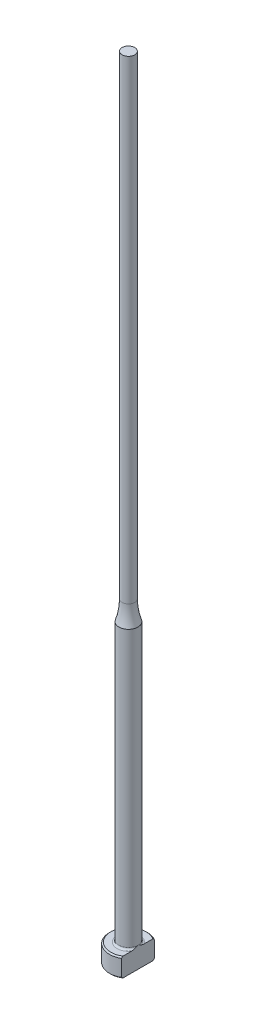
ISO-10303-21;
HEADER;
FILE_DESCRIPTION(('STEP AP214'),'2;1');
FILE_NAME('part.step','',(''),(''),'','','');
FILE_SCHEMA(('AUTOMOTIVE_DESIGN { 1 0 10303 214 1 1 1 1 }'));
ENDSEC;
DATA;
#1=APPLICATION_CONTEXT('core data for automotive mechanical design processes');
#2=APPLICATION_PROTOCOL_DEFINITION('international standard','automotive_design',2000,#1);
#3=PRODUCT_CONTEXT('',#1,'mechanical');
#4=PRODUCT('Part','Part','',(#3));
#5=PRODUCT_RELATED_PRODUCT_CATEGORY('part','',(#4));
#6=PRODUCT_DEFINITION_FORMATION('','',#4);
#7=PRODUCT_DEFINITION_CONTEXT('part definition',#1,'design');
#8=PRODUCT_DEFINITION('design','',#6,#7);
#9=PRODUCT_DEFINITION_SHAPE('','',#8);
#10=(LENGTH_UNIT() NAMED_UNIT(*) SI_UNIT(.MILLI.,.METRE.));
#11=(NAMED_UNIT(*) PLANE_ANGLE_UNIT() SI_UNIT($,.RADIAN.));
#12=(NAMED_UNIT(*) SI_UNIT($,.STERADIAN.) SOLID_ANGLE_UNIT());
#13=UNCERTAINTY_MEASURE_WITH_UNIT(LENGTH_MEASURE(1.E-05),#10,'distance_accuracy_value','');
#14=(GEOMETRIC_REPRESENTATION_CONTEXT(3) GLOBAL_UNCERTAINTY_ASSIGNED_CONTEXT((#13)) GLOBAL_UNIT_ASSIGNED_CONTEXT((#10,
#11,#12)) REPRESENTATION_CONTEXT('',''));
#15=CARTESIAN_POINT('',(0.,0.,0.));
#16=DIRECTION('',(0.,0.,1.));
#17=DIRECTION('',(1.,0.,0.));
#18=AXIS2_PLACEMENT_3D('',#15,#16,#17);
#19=CARTESIAN_POINT('',(-2.99999999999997,3.,0.));
#20=DIRECTION('',(0.,1.,0.));
#21=DIRECTION('',(0.,0.,1.));
#22=AXIS2_PLACEMENT_3D('',#19,#20,#21);
#23=PLANE('',#22);
#24=CARTESIAN_POINT('',(0.,3.,0.));
#25=DIRECTION('',(0.,1.,0.));
#26=DIRECTION('',(0.,0.,1.));
#27=AXIS2_PLACEMENT_3D('',#24,#25,#26);
#28=CIRCLE('',#27,2.79999999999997);
#29=CARTESIAN_POINT('',(1.49999999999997,3.,-2.36431808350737));
#30=VERTEX_POINT('',#29);
#31=CARTESIAN_POINT('',(1.49999999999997,3.,2.36431808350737));
#32=VERTEX_POINT('',#31);
#33=EDGE_CURVE('E187',#30,#32,#28,.T.);
#34=ORIENTED_EDGE('',*,*,#33,.T.);
#35=DIRECTION('',(0.,0.,-1.));
#36=VECTOR('',#35,1.);
#37=CARTESIAN_POINT('',(1.49999999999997,3.,0.));
#38=LINE('',#37,#36);
#39=CARTESIAN_POINT('',(1.49999999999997,3.00000000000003,0.99498743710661));
#40=VERTEX_POINT('',#39);
#41=EDGE_CURVE('E57',#32,#40,#38,.T.);
#42=ORIENTED_EDGE('',*,*,#41,.T.);
#43=CARTESIAN_POINT('',(0.,3.,0.));
#44=DIRECTION('',(0.,1.,0.));
#45=DIRECTION('',(0.,0.,1.));
#46=AXIS2_PLACEMENT_3D('',#43,#44,#45);
#47=CIRCLE('',#46,1.79999999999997);
#48=CARTESIAN_POINT('',(1.49999999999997,3.00000000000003,-0.994987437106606));
#49=VERTEX_POINT('',#48);
#50=EDGE_CURVE('E108',#40,#49,#47,.F.);
#51=ORIENTED_EDGE('',*,*,#50,.T.);
#52=EDGE_CURVE('E137',#49,#30,#38,.T.);
#53=ORIENTED_EDGE('',*,*,#52,.T.);
#54=EDGE_LOOP('',(#34,#42,#51,#53));
#55=FACE_BOUND('',#54,.T.);
#56=ADVANCED_FACE('F32',(#55),#23,.T.);
#57=CARTESIAN_POINT('',(0.,259.958771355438,0.));
#58=DIRECTION('',(0.,1.,0.));
#59=DIRECTION('',(0.,0.,1.));
#60=AXIS2_PLACEMENT_3D('',#57,#58,#59);
#61=CYLINDRICAL_SURFACE('',#60,2.99999999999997);
#62=CARTESIAN_POINT('',(0.,2.80000000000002,0.));
#63=DIRECTION('',(0.,1.,0.));
#64=DIRECTION('',(0.,0.,1.));
#65=AXIS2_PLACEMENT_3D('',#62,#63,#64);
#66=CIRCLE('',#65,2.99999999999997);
#67=CARTESIAN_POINT('',(1.49999999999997,2.80000000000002,2.5980762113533));
#68=VERTEX_POINT('',#67);
#69=CARTESIAN_POINT('',(1.49999999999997,2.80000000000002,-2.5980762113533));
#70=VERTEX_POINT('',#69);
#71=EDGE_CURVE('E105',#68,#70,#66,.F.);
#72=ORIENTED_EDGE('',*,*,#71,.T.);
#73=DIRECTION('',(0.,-1.,0.));
#74=VECTOR('',#73,1.);
#75=CARTESIAN_POINT('',(1.49999999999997,125.,-2.5980762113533));
#76=LINE('',#75,#74);
#77=CARTESIAN_POINT('',(1.49999999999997,0.200000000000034,-2.5980762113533));
#78=VERTEX_POINT('',#77);
#79=EDGE_CURVE('E193',#70,#78,#76,.T.);
#80=ORIENTED_EDGE('',*,*,#79,.T.);
#81=CARTESIAN_POINT('',(0.,0.200000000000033,0.));
#82=DIRECTION('',(0.,-1.,0.));
#83=DIRECTION('',(0.,0.,-1.));
#84=AXIS2_PLACEMENT_3D('',#81,#82,#83);
#85=CIRCLE('',#84,2.99999999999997);
#86=CARTESIAN_POINT('',(1.49999999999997,0.200000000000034,2.5980762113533));
#87=VERTEX_POINT('',#86);
#88=EDGE_CURVE('E100',#78,#87,#85,.F.);
#89=ORIENTED_EDGE('',*,*,#88,.T.);
#90=DIRECTION('',(0.,-1.,0.));
#91=VECTOR('',#90,1.);
#92=CARTESIAN_POINT('',(1.49999999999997,125.,2.5980762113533));
#93=LINE('',#92,#91);
#94=EDGE_CURVE('E93',#68,#87,#93,.T.);
#95=ORIENTED_EDGE('',*,*,#94,.F.);
#96=EDGE_LOOP('',(#72,#80,#89,#95));
#97=FACE_BOUND('',#96,.T.);
#98=ADVANCED_FACE('F158',(#97),#61,.T.);
#99=CARTESIAN_POINT('',(0.,0.,0.));
#100=DIRECTION('',(0.,-1.,0.));
#101=DIRECTION('',(0.,0.,-1.));
#102=AXIS2_PLACEMENT_3D('',#99,#100,#101);
#103=PLANE('',#102);
#104=CARTESIAN_POINT('',(0.,0.,0.));
#105=DIRECTION('',(0.,-1.,0.));
#106=DIRECTION('',(0.,0.,-1.));
#107=AXIS2_PLACEMENT_3D('',#104,#105,#106);
#108=CIRCLE('',#107,2.79999999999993);
#109=CARTESIAN_POINT('',(1.49999999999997,0.,2.36431808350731));
#110=VERTEX_POINT('',#109);
#111=CARTESIAN_POINT('',(1.49999999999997,0.,-2.36431808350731));
#112=VERTEX_POINT('',#111);
#113=EDGE_CURVE('E98',#110,#112,#108,.T.);
#114=ORIENTED_EDGE('',*,*,#113,.T.);
#115=DIRECTION('',(0.,0.,1.));
#116=VECTOR('',#115,1.);
#117=CARTESIAN_POINT('',(1.49999999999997,0.,-2.5980762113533));
#118=LINE('',#117,#116);
#119=EDGE_CURVE('E83',#112,#110,#118,.T.);
#120=ORIENTED_EDGE('',*,*,#119,.T.);
#121=EDGE_LOOP('',(#114,#120));
#122=FACE_BOUND('',#121,.T.);
#123=ADVANCED_FACE('F103',(#122),#103,.T.);
#124=CARTESIAN_POINT('',(0.,3.,0.));
#125=DIRECTION('',(0.,-1.,0.));
#126=DIRECTION('',(0.,0.,-1.));
#127=AXIS2_PLACEMENT_3D('',#124,#125,#126);
#128=CONICAL_SURFACE('',#127,2.79999999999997,0.7853981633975);
#129=ORIENTED_EDGE('',*,*,#71,.F.);
#130=CARTESIAN_POINT('',(1.49999999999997,-0.11174109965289,5.71827621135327));
#131=CARTESIAN_POINT('',(1.49999999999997,0.0136183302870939,5.58866816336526));
#132=CARTESIAN_POINT('',(1.49999999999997,0.138843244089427,5.45892957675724));
#133=CARTESIAN_POINT('',(1.49999999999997,0.388944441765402,5.19911365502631));
#134=CARTESIAN_POINT('',(1.49999999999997,0.513820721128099,5.06903631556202));
#135=CARTESIAN_POINT('',(1.49999999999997,0.763205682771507,4.8084018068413));
#136=CARTESIAN_POINT('',(1.49999999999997,0.887714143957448,4.67784442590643));
#137=CARTESIAN_POINT('',(1.49999999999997,1.13618059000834,4.41620813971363));
#138=CARTESIAN_POINT('',(1.49999999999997,1.2601385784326,4.28512923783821));
#139=CARTESIAN_POINT('',(1.49999999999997,1.50488975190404,4.02490837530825));
#140=CARTESIAN_POINT('',(1.49999999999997,1.6256969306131,3.89577958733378));
#141=CARTESIAN_POINT('',(1.49999999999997,1.86640694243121,3.63668213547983));
#142=CARTESIAN_POINT('',(1.49999999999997,1.98630978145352,3.5067134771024));
#143=CARTESIAN_POINT('',(1.49999999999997,2.22486033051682,3.24567921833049));
#144=CARTESIAN_POINT('',(1.49999999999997,2.34350830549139,3.11461386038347));
#145=CARTESIAN_POINT('',(1.49999999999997,2.57907716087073,2.85094268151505));
#146=CARTESIAN_POINT('',(1.49999999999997,2.69599811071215,2.71833692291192));
#147=CARTESIAN_POINT('',(1.49999999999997,2.88262371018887,2.50255231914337));
#148=CARTESIAN_POINT('',(1.49999999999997,2.95312454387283,2.42006293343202));
#149=CARTESIAN_POINT('',(1.49999999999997,3.09287098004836,2.25401084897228));
#150=CARTESIAN_POINT('',(1.49999999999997,3.16211645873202,2.170448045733));
#151=CARTESIAN_POINT('',(1.49999999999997,3.2996468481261,2.00105967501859));
#152=CARTESIAN_POINT('',(1.49999999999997,3.36791386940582,1.91521952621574));
#153=CARTESIAN_POINT('',(1.49999999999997,3.50205840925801,1.74171392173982));
#154=CARTESIAN_POINT('',(1.49999999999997,3.56793649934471,1.65404891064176));
#155=CARTESIAN_POINT('',(1.49999999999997,3.69728151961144,1.47490236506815));
#156=CARTESIAN_POINT('',(1.49999999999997,3.76069661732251,1.38338308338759));
#157=CARTESIAN_POINT('',(1.49999999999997,3.88239539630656,1.1967566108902));
#158=CARTESIAN_POINT('',(1.49999999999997,3.94067201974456,1.10164473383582));
#159=CARTESIAN_POINT('',(1.49999999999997,4.0484132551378,0.908008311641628));
#160=CARTESIAN_POINT('',(1.49999999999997,4.09797809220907,0.809540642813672));
#161=CARTESIAN_POINT('',(1.49999999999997,4.18432188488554,0.607192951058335));
#162=CARTESIAN_POINT('',(1.49999999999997,4.22114374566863,0.503332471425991));
#163=CARTESIAN_POINT('',(1.49999999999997,4.26099935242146,0.347577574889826));
#164=CARTESIAN_POINT('',(1.49999999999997,4.27157029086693,0.29760995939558));
#165=CARTESIAN_POINT('',(1.49999999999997,4.28794860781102,0.196885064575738));
#166=CARTESIAN_POINT('',(1.49999999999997,4.29375640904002,0.146127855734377));
#167=CARTESIAN_POINT('',(1.49999999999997,4.30019707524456,0.0444388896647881));
#168=CARTESIAN_POINT('',(1.49999999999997,4.30084594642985,-0.00649183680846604));
#169=CARTESIAN_POINT('',(1.49999999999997,4.29696416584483,-0.108155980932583));
#170=CARTESIAN_POINT('',(1.49999999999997,4.29243308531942,-0.158889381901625));
#171=CARTESIAN_POINT('',(1.49999999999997,4.27856915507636,-0.259234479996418));
#172=CARTESIAN_POINT('',(1.49999999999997,4.26927821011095,-0.308852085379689));
#173=CARTESIAN_POINT('',(1.49999999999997,4.24647108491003,-0.407110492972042));
#174=CARTESIAN_POINT('',(1.49999999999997,4.2329532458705,-0.455750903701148));
#175=CARTESIAN_POINT('',(1.49999999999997,4.20226175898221,-0.552149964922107));
#176=CARTESIAN_POINT('',(1.49999999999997,4.18506801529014,-0.599902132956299));
#177=CARTESIAN_POINT('',(1.49999999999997,4.14771387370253,-0.694205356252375));
#178=CARTESIAN_POINT('',(1.49999999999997,4.12755408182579,-0.740756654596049));
#179=CARTESIAN_POINT('',(1.49999999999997,4.06327696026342,-0.879166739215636));
#180=CARTESIAN_POINT('',(1.49999999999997,4.01551721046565,-0.969329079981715));
#181=CARTESIAN_POINT('',(1.49999999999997,3.91367909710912,-1.1460431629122));
#182=CARTESIAN_POINT('',(1.49999999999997,3.85959300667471,-1.23259031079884));
#183=CARTESIAN_POINT('',(1.49999999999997,3.74697968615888,-1.40321348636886));
#184=CARTESIAN_POINT('',(1.49999999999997,3.68843573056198,-1.48727838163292));
#185=CARTESIAN_POINT('',(1.49999999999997,3.56843845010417,-1.65322187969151));
#186=CARTESIAN_POINT('',(1.49999999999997,3.50698656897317,-1.73510153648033));
#187=CARTESIAN_POINT('',(1.49999999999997,3.38115673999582,-1.89829823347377));
#188=CARTESIAN_POINT('',(1.49999999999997,3.31675092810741,-1.9795936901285));
#189=CARTESIAN_POINT('',(1.49999999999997,3.18634068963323,-2.14090082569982));
#190=CARTESIAN_POINT('',(1.49999999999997,3.12033609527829,-2.22091236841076));
#191=CARTESIAN_POINT('',(1.49999999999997,2.9208643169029,-2.4590650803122));
#192=CARTESIAN_POINT('',(1.49999999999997,2.78562663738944,-2.6157209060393));
#193=CARTESIAN_POINT('',(1.49999999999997,2.53554498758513,-2.90006295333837));
#194=CARTESIAN_POINT('',(1.49999999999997,2.421145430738,-3.02814382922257));
#195=CARTESIAN_POINT('',(1.49999999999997,2.19093557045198,-3.28303767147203));
#196=CARTESIAN_POINT('',(1.49999999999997,2.07512522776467,-3.40985060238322));
#197=CARTESIAN_POINT('',(1.49999999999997,1.72597067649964,-3.78913849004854));
#198=CARTESIAN_POINT('',(1.49999999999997,1.49111760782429,-4.04022177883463));
#199=CARTESIAN_POINT('',(1.49999999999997,1.02882478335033,-4.52992803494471));
#200=CARTESIAN_POINT('',(1.49999999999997,0.801477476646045,-4.76863870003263));
#201=CARTESIAN_POINT('',(1.49999999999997,0.459548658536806,-5.12558036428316));
#202=CARTESIAN_POINT('',(1.49999999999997,0.345484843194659,-5.24430773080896));
#203=CARTESIAN_POINT('',(1.49999999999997,0.117071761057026,-5.48148573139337));
#204=CARTESIAN_POINT('',(1.49999999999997,0.00272249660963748,-5.59993636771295));
#205=CARTESIAN_POINT('',(1.49999999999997,-0.111741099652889,-5.71827621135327));
#206=B_SPLINE_CURVE_WITH_KNOTS('',3,(#130,#131,#132,#133,#134,#135,#136,#137,#138,#139,#140,
#141,#142,#143,#144,#145,#146,#147,#148,#149,#150,#151,#152,#153,#154,#155,#156,#157,#158,#159,
#160,#161,#162,#163,#164,#165,#166,#167,#168,#169,#170,#171,#172,#173,#174,#175,#176,#177,#178,
#179,#180,#181,#182,#183,#184,#185,#186,#187,#188,#189,#190,#191,#192,#193,#194,#195,#196,#197,
#198,#199,#200,#201,#202,#203,#204,#205),.UNSPECIFIED.,.F.,.F.,(4,2,2,2,2,2,2,2,2,2,2,2,2,2,2,2,
2,2,2,2,2,2,2,2,2,2,2,2,2,2,2,2,2,2,2,2,2,4),(0.,0.540943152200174,1.08189327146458,
1.62312052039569,2.16434426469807,2.69482920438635,3.22531067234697,3.75567781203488,
4.28602356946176,4.61155053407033,4.93710943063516,5.26610945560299,5.59503024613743,
5.92894782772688,6.26331713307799,6.59354403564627,6.92264800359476,7.07567478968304,
7.22868799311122,7.38122626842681,7.53377717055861,7.68500755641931,7.83629736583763,
7.98843643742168,8.14054446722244,8.4461879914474,8.75220879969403,9.05944044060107,
9.366521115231,9.677642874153,9.98879742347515,10.6095925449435,11.1247803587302,
11.6399825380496,12.6713544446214,13.6603005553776,14.1542238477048,14.648143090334),.UNSPECIFIED.);
#207=EDGE_CURVE('E136',#68,#32,#206,.T.);
#208=ORIENTED_EDGE('',*,*,#207,.T.);
#209=ORIENTED_EDGE('',*,*,#33,.F.);
#210=EDGE_CURVE('E128',#30,#70,#206,.T.);
#211=ORIENTED_EDGE('',*,*,#210,.T.);
#212=EDGE_LOOP('',(#129,#208,#209,#211));
#213=FACE_BOUND('',#212,.T.);
#214=ADVANCED_FACE('F144',(#213),#128,.T.);
#215=CARTESIAN_POINT('',(0.,0.200000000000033,0.));
#216=DIRECTION('',(0.,1.,0.));
#217=DIRECTION('',(0.,0.,1.));
#218=AXIS2_PLACEMENT_3D('',#215,#216,#217);
#219=CONICAL_SURFACE('',#218,2.99999999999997,0.785398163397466);
#220=ORIENTED_EDGE('',*,*,#88,.F.);
#221=CARTESIAN_POINT('',(1.49999999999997,3.11174109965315,-5.71827621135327));
#222=CARTESIAN_POINT('',(1.49999999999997,2.98638166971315,-5.58866816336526));
#223=CARTESIAN_POINT('',(1.49999999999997,2.8611567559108,-5.45892957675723));
#224=CARTESIAN_POINT('',(1.49999999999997,2.6110555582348,-5.19911365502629));
#225=CARTESIAN_POINT('',(1.49999999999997,2.48617927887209,-5.06903631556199));
#226=CARTESIAN_POINT('',(1.49999999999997,2.23679431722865,-4.80840180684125));
#227=CARTESIAN_POINT('',(1.49999999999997,2.11228585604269,-4.67784442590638));
#228=CARTESIAN_POINT('',(1.49999999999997,1.86381940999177,-4.41620813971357));
#229=CARTESIAN_POINT('',(1.49999999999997,1.7398614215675,-4.28512923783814));
#230=CARTESIAN_POINT('',(1.49999999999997,1.49511024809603,-4.02490837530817));
#231=CARTESIAN_POINT('',(1.49999999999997,1.37430306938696,-3.89577958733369));
#232=CARTESIAN_POINT('',(1.49999999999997,1.13359305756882,-3.63668213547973));
#233=CARTESIAN_POINT('',(1.49999999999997,1.0136902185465,-3.50671347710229));
#234=CARTESIAN_POINT('',(1.49999999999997,0.775139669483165,-3.24567921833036));
#235=CARTESIAN_POINT('',(1.49999999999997,0.656491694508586,-3.11461386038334));
#236=CARTESIAN_POINT('',(1.49999999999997,0.420922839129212,-2.85094268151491));
#237=CARTESIAN_POINT('',(1.49999999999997,0.304001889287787,-2.71833692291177));
#238=CARTESIAN_POINT('',(1.49999999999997,0.117376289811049,-2.50255231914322));
#239=CARTESIAN_POINT('',(1.49999999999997,0.0468754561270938,-2.42006293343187));
#240=CARTESIAN_POINT('',(1.49999999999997,-0.0928709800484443,-2.25401084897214));
#241=CARTESIAN_POINT('',(1.49999999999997,-0.162116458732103,-2.17044804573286));
#242=CARTESIAN_POINT('',(1.49999999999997,-0.299646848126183,-2.00105967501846));
#243=CARTESIAN_POINT('',(1.49999999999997,-0.367913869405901,-1.91521952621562));
#244=CARTESIAN_POINT('',(1.49999999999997,-0.502058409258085,-1.74171392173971));
#245=CARTESIAN_POINT('',(1.49999999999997,-0.567936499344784,-1.65404891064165));
#246=CARTESIAN_POINT('',(1.49999999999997,-0.697281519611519,-1.47490236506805));
#247=CARTESIAN_POINT('',(1.49999999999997,-0.760696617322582,-1.38338308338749));
#248=CARTESIAN_POINT('',(1.49999999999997,-0.882395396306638,-1.19675661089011));
#249=CARTESIAN_POINT('',(1.49999999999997,-0.940672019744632,-1.10164473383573));
#250=CARTESIAN_POINT('',(1.49999999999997,-1.04841325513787,-0.908008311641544));
#251=CARTESIAN_POINT('',(1.49999999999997,-1.09797809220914,-0.809540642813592));
#252=CARTESIAN_POINT('',(1.49999999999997,-1.1843218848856,-0.60719295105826));
#253=CARTESIAN_POINT('',(1.49999999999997,-1.22114374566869,-0.503332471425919));
#254=CARTESIAN_POINT('',(1.49999999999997,-1.26099935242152,-0.347577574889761));
#255=CARTESIAN_POINT('',(1.49999999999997,-1.27157029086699,-0.29760995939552));
#256=CARTESIAN_POINT('',(1.49999999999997,-1.28794860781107,-0.196885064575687));
#257=CARTESIAN_POINT('',(1.49999999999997,-1.29375640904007,-0.146127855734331));
#258=CARTESIAN_POINT('',(1.49999999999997,-1.30019707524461,-0.0444388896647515));
#259=CARTESIAN_POINT('',(1.49999999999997,-1.3008459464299,0.00649183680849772));
#260=CARTESIAN_POINT('',(1.49999999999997,-1.29696416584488,0.108155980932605));
#261=CARTESIAN_POINT('',(1.49999999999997,-1.29243308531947,0.158889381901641));
#262=CARTESIAN_POINT('',(1.49999999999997,-1.2785691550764,0.259234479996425));
#263=CARTESIAN_POINT('',(1.49999999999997,-1.26927821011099,0.308852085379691));
#264=CARTESIAN_POINT('',(1.49999999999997,-1.24647108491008,0.407110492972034));
#265=CARTESIAN_POINT('',(1.49999999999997,-1.23295324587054,0.455750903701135));
#266=CARTESIAN_POINT('',(1.49999999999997,-1.20226175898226,0.552149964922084));
#267=CARTESIAN_POINT('',(1.49999999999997,-1.18506801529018,0.599902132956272));
#268=CARTESIAN_POINT('',(1.49999999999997,-1.14771387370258,0.694205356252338));
#269=CARTESIAN_POINT('',(1.49999999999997,-1.12755408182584,0.740756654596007));
#270=CARTESIAN_POINT('',(1.49999999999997,-1.06327696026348,0.879166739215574));
#271=CARTESIAN_POINT('',(1.49999999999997,-1.01551721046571,0.969329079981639));
#272=CARTESIAN_POINT('',(1.49999999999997,-0.913679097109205,1.1460431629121));
#273=CARTESIAN_POINT('',(1.49999999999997,-0.8595930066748,1.23259031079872));
#274=CARTESIAN_POINT('',(1.49999999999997,-0.746979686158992,1.40321348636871));
#275=CARTESIAN_POINT('',(1.49999999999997,-0.688435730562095,1.48727838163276));
#276=CARTESIAN_POINT('',(1.49999999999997,-0.568438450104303,1.65322187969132));
#277=CARTESIAN_POINT('',(1.49999999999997,-0.506986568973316,1.73510153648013));
#278=CARTESIAN_POINT('',(1.49999999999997,-0.381156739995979,1.89829823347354));
#279=CARTESIAN_POINT('',(1.49999999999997,-0.316750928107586,1.97959369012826));
#280=CARTESIAN_POINT('',(1.49999999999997,-0.186340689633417,2.14090082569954));
#281=CARTESIAN_POINT('',(1.49999999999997,-0.120336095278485,2.22091236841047));
#282=CARTESIAN_POINT('',(1.49999999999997,0.0791356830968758,2.45906508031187));
#283=CARTESIAN_POINT('',(1.49999999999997,0.214373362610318,2.61572090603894));
#284=CARTESIAN_POINT('',(1.49999999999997,0.46445501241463,2.90006295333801));
#285=CARTESIAN_POINT('',(1.49999999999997,0.578854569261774,3.02814382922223));
#286=CARTESIAN_POINT('',(1.49999999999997,0.809064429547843,3.28303767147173));
#287=CARTESIAN_POINT('',(1.49999999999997,0.924874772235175,3.40985060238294));
#288=CARTESIAN_POINT('',(1.49999999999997,1.27402932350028,3.78913849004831));
#289=CARTESIAN_POINT('',(1.49999999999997,1.50888239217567,4.04022177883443));
#290=CARTESIAN_POINT('',(1.49999999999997,1.97117521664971,4.52992803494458));
#291=CARTESIAN_POINT('',(1.49999999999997,2.19852252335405,4.76863870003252));
#292=CARTESIAN_POINT('',(1.49999999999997,2.54045134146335,5.12558036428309));
#293=CARTESIAN_POINT('',(1.49999999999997,2.65451515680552,5.2443077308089));
#294=CARTESIAN_POINT('',(1.49999999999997,2.88292823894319,5.48148573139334));
#295=CARTESIAN_POINT('',(1.49999999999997,2.9972775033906,5.59993636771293));
#296=CARTESIAN_POINT('',(1.49999999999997,3.11174109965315,5.71827621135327));
#297=B_SPLINE_CURVE_WITH_KNOTS('',3,(#221,#222,#223,#224,#225,#226,#227,#228,#229,#230,#231,
#232,#233,#234,#235,#236,#237,#238,#239,#240,#241,#242,#243,#244,#245,#246,#247,#248,#249,#250,
#251,#252,#253,#254,#255,#256,#257,#258,#259,#260,#261,#262,#263,#264,#265,#266,#267,#268,#269,
#270,#271,#272,#273,#274,#275,#276,#277,#278,#279,#280,#281,#282,#283,#284,#285,#286,#287,#288,
#289,#290,#291,#292,#293,#294,#295,#296),.UNSPECIFIED.,.F.,.F.,(4,2,2,2,2,2,2,2,2,2,2,2,2,2,2,2,
2,2,2,2,2,2,2,2,2,2,2,2,2,2,2,2,2,2,2,2,2,4),(0.,0.540943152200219,1.08189327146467,
1.62312052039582,2.16434426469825,2.69482920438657,3.22531067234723,3.75567781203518,
4.28602356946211,4.61155053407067,4.93710943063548,5.2661094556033,5.59503024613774,
5.92894782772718,6.26331713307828,6.59354403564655,6.92264800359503,7.0756747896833,
7.22868799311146,7.38122626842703,7.53377717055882,7.68500755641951,7.83629736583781,
7.98843643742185,8.14054446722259,8.4461879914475,8.75220879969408,9.05944044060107,
9.36652111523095,9.6776428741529,9.98879742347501,10.6095925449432,11.1247803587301,
11.6399825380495,12.6713544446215,13.6603005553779,14.1542238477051,14.6481430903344),.UNSPECIFIED.);
#298=EDGE_CURVE('E86',#78,#112,#297,.T.);
#299=ORIENTED_EDGE('',*,*,#298,.T.);
#300=ORIENTED_EDGE('',*,*,#113,.F.);
#301=EDGE_CURVE('E89',#110,#87,#297,.T.);
#302=ORIENTED_EDGE('',*,*,#301,.T.);
#303=EDGE_LOOP('',(#220,#299,#300,#302));
#304=FACE_BOUND('',#303,.T.);
#305=ADVANCED_FACE('F97',(#304),#219,.T.);
#306=CARTESIAN_POINT('',(0.,3.30000000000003,0.));
#307=DIRECTION('',(0.,1.,0.));
#308=DIRECTION('',(0.,0.,1.));
#309=AXIS2_PLACEMENT_3D('',#306,#307,#308);
#310=TOROIDAL_SURFACE('',#309,1.79999999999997,0.3);
#311=CARTESIAN_POINT('',(1.49999999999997,3.30000000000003,0.));
#312=CARTESIAN_POINT('',(1.49999999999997,3.300000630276,3.41555678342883E-12));
#313=CARTESIAN_POINT('',(1.49999999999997,3.30000126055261,-1.15373640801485E-07));
#314=CARTESIAN_POINT('',(1.49999999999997,3.3000024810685,-4.90631575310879E-07));
#315=CARTESIAN_POINT('',(1.49999999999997,3.30000307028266,-7.53296670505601E-07));
#316=CARTESIAN_POINT('',(1.49999999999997,3.30000424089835,-1.38757096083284E-06));
#317=CARTESIAN_POINT('',(1.49999999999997,3.300004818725,-1.76563001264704E-06));
#318=CARTESIAN_POINT('',(1.49999999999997,3.30000591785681,-2.58768006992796E-06));
#319=CARTESIAN_POINT('',(1.49999999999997,3.30000643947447,-3.03127014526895E-06));
#320=CARTESIAN_POINT('',(1.49999999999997,3.30000815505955,-4.60021967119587E-06));
#321=CARTESIAN_POINT('',(1.49999999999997,3.30000927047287,-5.8124152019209E-06));
#322=CARTESIAN_POINT('',(1.49999999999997,3.30001128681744,-8.33989413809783E-06));
#323=CARTESIAN_POINT('',(1.49999999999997,3.30001219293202,-9.65128157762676E-06));
#324=CARTESIAN_POINT('',(1.49999999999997,3.30001551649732,-1.46782505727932E-05));
#325=CARTESIAN_POINT('',(1.49999999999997,3.30001775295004,-1.8517976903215E-05));
#326=CARTESIAN_POINT('',(1.49999999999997,3.30002148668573,-2.61616194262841E-05));
#327=CARTESIAN_POINT('',(1.49999999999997,3.30002302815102,-2.99447742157E-05));
#328=CARTESIAN_POINT('',(1.49999999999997,3.30002943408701,-4.58003743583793E-05));
#329=CARTESIAN_POINT('',(1.49999999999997,3.3000341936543,-5.79079078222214E-05));
#330=CARTESIAN_POINT('',(1.49999999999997,3.30004197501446,-8.07263755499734E-05));
#331=CARTESIAN_POINT('',(1.49999999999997,3.30004514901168,-9.13834709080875E-05));
#332=CARTESIAN_POINT('',(1.49999999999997,3.30006989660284,-0.000167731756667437));
#333=CARTESIAN_POINT('',(1.49999999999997,3.30010092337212,-0.000229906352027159));
#334=CARTESIAN_POINT('',(1.49999999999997,3.30021632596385,-0.000470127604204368));
#335=CARTESIAN_POINT('',(1.49999999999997,3.30029368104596,-0.000650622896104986));
#336=CARTESIAN_POINT('',(1.49999999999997,3.30059619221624,-0.00134589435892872));
#337=CARTESIAN_POINT('',(1.49999999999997,3.30082870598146,-0.00185814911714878));
#338=CARTESIAN_POINT('',(1.49999999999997,3.30176696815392,-0.00393547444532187));
#339=CARTESIAN_POINT('',(1.49999999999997,3.30246445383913,-0.00550332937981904));
#340=CARTESIAN_POINT('',(1.49999999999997,3.31426785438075,-0.0320229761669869));
#341=CARTESIAN_POINT('',(1.49999999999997,3.32544800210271,-0.0569503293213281));
#342=CARTESIAN_POINT('',(1.49999999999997,3.34725700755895,-0.105984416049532));
#343=CARTESIAN_POINT('',(1.49999999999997,3.35789134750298,-0.130088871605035));
#344=CARTESIAN_POINT('',(1.49999999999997,3.38015321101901,-0.181096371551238));
#345=CARTESIAN_POINT('',(1.49999999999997,3.39175804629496,-0.208009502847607));
#346=CARTESIAN_POINT('',(1.49999999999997,3.41469034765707,-0.262264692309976));
#347=CARTESIAN_POINT('',(1.49999999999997,3.42601398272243,-0.289608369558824));
#348=CARTESIAN_POINT('',(1.49999999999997,3.45363212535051,-0.35820378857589));
#349=CARTESIAN_POINT('',(1.49999999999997,3.46959026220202,-0.39959288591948));
#350=CARTESIAN_POINT('',(1.49999999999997,3.49940505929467,-0.482097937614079));
#351=CARTESIAN_POINT('',(1.49999999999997,3.51330033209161,-0.523199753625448));
#352=CARTESIAN_POINT('',(1.49999999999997,3.53552507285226,-0.595497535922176));
#353=CARTESIAN_POINT('',(1.49999999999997,3.54436834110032,-0.626532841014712));
#354=CARTESIAN_POINT('',(1.49999999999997,3.56052427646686,-0.6891760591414));
#355=CARTESIAN_POINT('',(1.49999999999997,3.5678279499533,-0.720786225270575));
#356=CARTESIAN_POINT('',(1.49999999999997,3.5875075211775,-0.819524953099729));
#357=CARTESIAN_POINT('',(1.49999999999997,3.59661044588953,-0.88742909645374));
#358=CARTESIAN_POINT('',(1.49999999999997,3.60059842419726,-0.991180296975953));
#359=CARTESIAN_POINT('',(1.49999999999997,3.60019840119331,-1.02684364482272));
#360=CARTESIAN_POINT('',(1.49999999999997,3.59497085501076,-1.097505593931));
#361=CARTESIAN_POINT('',(1.49999999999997,3.59019295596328,-1.13250716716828));
#362=CARTESIAN_POINT('',(1.49999999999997,3.57687734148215,-1.19353096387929));
#363=CARTESIAN_POINT('',(1.49999999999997,3.56943875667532,-1.21978854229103));
#364=CARTESIAN_POINT('',(1.49999999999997,3.55063748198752,-1.27094658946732));
#365=CARTESIAN_POINT('',(1.49999999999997,3.53927342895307,-1.29584658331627));
#366=CARTESIAN_POINT('',(1.49999999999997,3.51660016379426,-1.33501873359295));
#367=CARTESIAN_POINT('',(1.49999999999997,3.50657738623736,-1.35003296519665));
#368=CARTESIAN_POINT('',(1.49999999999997,3.48437469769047,-1.37837252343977));
#369=CARTESIAN_POINT('',(1.49999999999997,3.47219867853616,-1.39170082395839));
#370=CARTESIAN_POINT('',(1.49999999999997,3.44835614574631,-1.41349417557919));
#371=CARTESIAN_POINT('',(1.49999999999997,3.43709185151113,-1.42239673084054));
#372=CARTESIAN_POINT('',(1.49999999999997,3.41325256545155,-1.43825467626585));
#373=CARTESIAN_POINT('',(1.49999999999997,3.40067804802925,-1.44521076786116));
#374=CARTESIAN_POINT('',(1.49999999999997,3.37433767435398,-1.45677158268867));
#375=CARTESIAN_POINT('',(1.49999999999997,3.36056203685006,-1.46135438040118));
#376=CARTESIAN_POINT('',(1.49999999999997,3.33237324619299,-1.46767730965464));
#377=CARTESIAN_POINT('',(1.49999999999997,3.31796076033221,-1.46942034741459));
#378=CARTESIAN_POINT('',(1.49999999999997,3.29122479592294,-1.4698720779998));
#379=CARTESIAN_POINT('',(1.49999999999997,3.27890664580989,-1.468990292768));
#380=CARTESIAN_POINT('',(1.49999999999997,3.25461019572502,-1.4651157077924));
#381=CARTESIAN_POINT('',(1.49999999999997,3.2426318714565,-1.46212305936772));
#382=CARTESIAN_POINT('',(1.49999999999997,3.21959683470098,-1.4543117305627));
#383=CARTESIAN_POINT('',(1.49999999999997,3.20852542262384,-1.44953579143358));
#384=CARTESIAN_POINT('',(1.49999999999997,3.18721125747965,-1.43840957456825));
#385=CARTESIAN_POINT('',(1.49999999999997,3.1769687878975,-1.43205876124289));
#386=CARTESIAN_POINT('',(1.49999999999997,3.15325976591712,-1.41506353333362));
#387=CARTESIAN_POINT('',(1.49999999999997,3.14027750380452,-1.40374235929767));
#388=CARTESIAN_POINT('',(1.49999999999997,3.11630720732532,-1.37914825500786));
#389=CARTESIAN_POINT('',(1.49999999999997,3.10532420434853,-1.36587054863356));
#390=CARTESIAN_POINT('',(1.49999999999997,3.08100891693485,-1.33197272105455));
#391=CARTESIAN_POINT('',(1.49999999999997,3.06867625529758,-1.31063843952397));
#392=CARTESIAN_POINT('',(1.49999999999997,3.04751867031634,-1.26637455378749));
#393=CARTESIAN_POINT('',(1.49999999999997,3.03869240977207,-1.24344556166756));
#394=CARTESIAN_POINT('',(1.49999999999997,3.01978360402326,-1.18316534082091));
#395=CARTESIAN_POINT('',(1.49999999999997,3.01191472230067,-1.14512623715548));
#396=CARTESIAN_POINT('',(1.49999999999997,3.00188285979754,-1.06789971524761));
#397=CARTESIAN_POINT('',(1.49999999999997,2.99979735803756,-1.02870374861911));
#398=CARTESIAN_POINT('',(1.49999999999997,3.00021727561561,-0.953160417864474));
#399=CARTESIAN_POINT('',(1.49999999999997,3.00240673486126,-0.916808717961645));
#400=CARTESIAN_POINT('',(1.49999999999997,3.0099643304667,-0.844432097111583));
#401=CARTESIAN_POINT('',(1.49999999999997,3.01533462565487,-0.808407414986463));
#402=CARTESIAN_POINT('',(1.49999999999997,3.02828086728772,-0.738670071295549));
#403=CARTESIAN_POINT('',(1.49999999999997,3.03573028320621,-0.704933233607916));
#404=CARTESIAN_POINT('',(1.49999999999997,3.05243174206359,-0.638128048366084));
#405=CARTESIAN_POINT('',(1.49999999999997,3.06167285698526,-0.605056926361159));
#406=CARTESIAN_POINT('',(1.49999999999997,3.08440652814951,-0.53019513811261));
#407=CARTESIAN_POINT('',(1.49999999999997,3.09836576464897,-0.488547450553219));
#408=CARTESIAN_POINT('',(1.49999999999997,3.1283820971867,-0.404954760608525));
#409=CARTESIAN_POINT('',(1.49999999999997,3.14447968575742,-0.363024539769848));
#410=CARTESIAN_POINT('',(1.49999999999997,3.17238454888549,-0.293508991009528));
#411=CARTESIAN_POINT('',(1.49999999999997,3.18384249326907,-0.265781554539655));
#412=CARTESIAN_POINT('',(1.49999999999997,3.20705854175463,-0.210769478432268));
#413=CARTESIAN_POINT('',(1.49999999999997,3.21881265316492,-0.183483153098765));
#414=CARTESIAN_POINT('',(1.49999999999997,3.24136702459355,-0.131772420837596));
#415=CARTESIAN_POINT('',(1.49999999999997,3.25214361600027,-0.107337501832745));
#416=CARTESIAN_POINT('',(1.49999999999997,3.27424746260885,-0.0576321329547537));
#417=CARTESIAN_POINT('',(1.49999999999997,3.28558038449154,-0.0323640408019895));
#418=CARTESIAN_POINT('',(1.49999999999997,3.29753556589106,-0.00550327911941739));
#419=CARTESIAN_POINT('',(1.49999999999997,3.29823307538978,-0.00393537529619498));
#420=CARTESIAN_POINT('',(1.49999999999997,3.29917134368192,-0.00185803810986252));
#421=CARTESIAN_POINT('',(1.49999999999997,3.29940384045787,-0.00134582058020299));
#422=CARTESIAN_POINT('',(1.49999999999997,3.29970633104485,-0.000650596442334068));
#423=CARTESIAN_POINT('',(1.49999999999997,3.29978368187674,-0.000470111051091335));
#424=CARTESIAN_POINT('',(1.49999999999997,3.29989907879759,-0.000229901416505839));
#425=CARTESIAN_POINT('',(1.49999999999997,3.29993010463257,-0.000167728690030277));
#426=CARTESIAN_POINT('',(1.49999999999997,3.29995485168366,-9.13825689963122E-05));
#427=CARTESIAN_POINT('',(1.49999999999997,3.29995802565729,-8.07256241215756E-05));
#428=CARTESIAN_POINT('',(1.49999999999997,3.29996580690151,-5.79074820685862E-05));
#429=CARTESIAN_POINT('',(1.49999999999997,3.29997056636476,-4.5800119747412E-05));
#430=CARTESIAN_POINT('',(1.49999999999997,3.29997697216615,-2.99447119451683E-05));
#431=CARTESIAN_POINT('',(1.49999999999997,3.2999785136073,-2.61615817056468E-05));
#432=CARTESIAN_POINT('',(1.49999999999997,3.2999822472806,-1.85179845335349E-05));
#433=CARTESIAN_POINT('',(1.49999999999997,3.29998448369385,-1.46782782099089E-05));
#434=CARTESIAN_POINT('',(1.49999999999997,3.2999878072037,-9.65132752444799E-06));
#435=CARTESIAN_POINT('',(1.49999999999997,3.299988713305,-8.33994202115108E-06));
#436=CARTESIAN_POINT('',(1.49999999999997,3.29999072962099,-5.81246426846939E-06));
#437=CARTESIAN_POINT('',(1.49999999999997,3.29999184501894,-4.600267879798E-06));
#438=CARTESIAN_POINT('',(1.49999999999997,3.29999356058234,-3.03131394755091E-06));
#439=CARTESIAN_POINT('',(1.49999999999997,3.29999408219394,-2.58772196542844E-06));
#440=CARTESIAN_POINT('',(1.49999999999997,3.2999951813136,-1.76566701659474E-06));
#441=CARTESIAN_POINT('',(1.49999999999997,3.29999575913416,-1.38760497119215E-06));
#442=CARTESIAN_POINT('',(1.49999999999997,3.29999692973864,-7.53323425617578E-07));
#443=CARTESIAN_POINT('',(1.49999999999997,3.29999751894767,-4.90654189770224E-07));
#444=CARTESIAN_POINT('',(1.49999999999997,3.29999873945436,-1.15386267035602E-07));
#445=CARTESIAN_POINT('',(1.49999999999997,3.29999936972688,-3.41554144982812E-12));
#446=CARTESIAN_POINT('',(1.49999999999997,3.30000000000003,0.));
#447=B_SPLINE_CURVE_WITH_KNOTS('',3,(#311,#312,#313,#314,#315,#316,#317,#318,#319,#320,#321,
#322,#323,#324,#325,#326,#327,#328,#329,#330,#331,#332,#333,#334,#335,#336,#337,#338,#339,#340,
#341,#342,#343,#344,#345,#346,#347,#348,#349,#350,#351,#352,#353,#354,#355,#356,#357,#358,#359,
#360,#361,#362,#363,#364,#365,#366,#367,#368,#369,#370,#371,#372,#373,#374,#375,#376,#377,#378,
#379,#380,#381,#382,#383,#384,#385,#386,#387,#388,#389,#390,#391,#392,#393,#394,#395,#396,#397,
#398,#399,#400,#401,#402,#403,#404,#405,#406,#407,#408,#409,#410,#411,#412,#413,#414,#415,#416,
#417,#418,#419,#420,#421,#422,#423,#424,#425,#426,#427,#428,#429,#430,#431,#432,#433,#434,#435,
#436,#437,#438,#439,#440,#441,#442,#443,#444,#445,#446),.UNSPECIFIED.,.T.,.F.,(4,2,2,2,2,2,2,2,
2,2,2,2,2,2,2,2,2,2,2,2,2,2,2,2,2,2,2,2,2,2,2,2,2,2,2,2,2,2,2,2,2,2,2,2,2,2,2,2,2,2,2,2,2,2,2,2,
2,2,2,2,2,2,2,2,2,2,2,4),(0.,1.88906036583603E-06,3.8150959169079E-06,5.87892837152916E-06,
7.93062024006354E-06,1.28480890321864E-05,1.76261717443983E-05,3.0909918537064E-05,
4.31529750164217E-05,8.21699329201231E-05,0.000115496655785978,0.000323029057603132,
0.000912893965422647,0.00259963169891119,0.00774858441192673,0.0896975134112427,
0.168737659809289,0.256660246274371,0.345444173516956,0.478492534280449,0.608603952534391,
0.705372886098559,0.802692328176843,1.00719557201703,1.11399616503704,1.21960092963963,
1.30124317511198,1.38291380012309,1.43690814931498,1.49080588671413,1.53371524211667,
1.57660911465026,1.61989249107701,1.66313154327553,1.69999492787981,1.73685567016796,
1.77288440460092,1.80892540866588,1.86031324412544,1.91182866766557,1.98534297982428,
2.05882922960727,2.1747172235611,2.29215041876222,2.40123170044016,2.51038710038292,
2.613972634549,2.71694519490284,2.84866234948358,2.98337525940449,3.07337666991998,
3.16250453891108,3.24262397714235,3.32569301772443,3.3308421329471,3.33252874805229,
3.33311858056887,3.33332610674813,3.33335943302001,3.33339844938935,3.3334106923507,
3.33342397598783,3.33342875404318,3.33343367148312,3.33343572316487,3.33343778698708,
3.33343971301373,3.33344160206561),.UNSPECIFIED.);
#448=CARTESIAN_POINT('',(1.49999999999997,3.30000000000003,0.));
#449=VERTEX_POINT('',#448);
#450=EDGE_CURVE('E11',#49,#449,#447,.T.);
#451=ORIENTED_EDGE('',*,*,#450,.F.);
#452=ORIENTED_EDGE('',*,*,#50,.F.);
#453=CARTESIAN_POINT('',(1.49999999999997,3.30000000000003,0.));
#454=CARTESIAN_POINT('',(1.49999999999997,3.29999936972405,-3.41547770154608E-12));
#455=CARTESIAN_POINT('',(1.49999999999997,3.29999873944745,1.15373640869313E-07));
#456=CARTESIAN_POINT('',(1.49999999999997,3.29999751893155,4.90631575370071E-07));
#457=CARTESIAN_POINT('',(1.49999999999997,3.29999692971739,7.53296670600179E-07));
#458=CARTESIAN_POINT('',(1.49999999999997,3.2999957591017,1.38757096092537E-06));
#459=CARTESIAN_POINT('',(1.49999999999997,3.29999518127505,1.76563001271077E-06));
#460=CARTESIAN_POINT('',(1.49999999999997,3.29999408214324,2.58768007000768E-06));
#461=CARTESIAN_POINT('',(1.49999999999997,3.29999356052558,3.03127014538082E-06));
#462=CARTESIAN_POINT('',(1.49999999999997,3.2999918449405,4.60021967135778E-06));
#463=CARTESIAN_POINT('',(1.49999999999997,3.29999072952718,5.81241520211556E-06));
#464=CARTESIAN_POINT('',(1.49999999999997,3.29998871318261,8.33989413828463E-06));
#465=CARTESIAN_POINT('',(1.49999999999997,3.29998780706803,9.65128157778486E-06));
#466=CARTESIAN_POINT('',(1.49999999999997,3.29998448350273,1.46782505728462E-05));
#467=CARTESIAN_POINT('',(1.49999999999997,3.29998224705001,1.85179769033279E-05));
#468=CARTESIAN_POINT('',(1.49999999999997,3.29997851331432,2.61616194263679E-05));
#469=CARTESIAN_POINT('',(1.49999999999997,3.29997697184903,2.99447742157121E-05));
#470=CARTESIAN_POINT('',(1.49999999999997,3.29997056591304,4.58003743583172E-05));
#471=CARTESIAN_POINT('',(1.49999999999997,3.29996580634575,5.79079078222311E-05));
#472=CARTESIAN_POINT('',(1.49999999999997,3.29995802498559,8.07263755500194E-05));
#473=CARTESIAN_POINT('',(1.49999999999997,3.29995485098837,9.1383470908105E-05));
#474=CARTESIAN_POINT('',(1.49999999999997,3.29993010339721,0.000167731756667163));
#475=CARTESIAN_POINT('',(1.49999999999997,3.29989907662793,0.000229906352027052));
#476=CARTESIAN_POINT('',(1.49999999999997,3.2997836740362,0.000470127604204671));
#477=CARTESIAN_POINT('',(1.49999999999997,3.2997063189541,0.000650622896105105));
#478=CARTESIAN_POINT('',(1.49999999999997,3.29940380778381,0.00134589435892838));
#479=CARTESIAN_POINT('',(1.49999999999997,3.29917129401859,0.00185814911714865));
#480=CARTESIAN_POINT('',(1.49999999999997,3.29823303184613,0.00393547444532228));
#481=CARTESIAN_POINT('',(1.49999999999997,3.29753554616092,0.00550332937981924));
#482=CARTESIAN_POINT('',(1.49999999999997,3.2857321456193,0.0320229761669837));
#483=CARTESIAN_POINT('',(1.49999999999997,3.27455199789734,0.0569503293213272));
#484=CARTESIAN_POINT('',(1.49999999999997,3.2527429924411,0.105984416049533));
#485=CARTESIAN_POINT('',(1.49999999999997,3.24210865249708,0.130088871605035));
#486=CARTESIAN_POINT('',(1.49999999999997,3.21984678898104,0.181096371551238));
#487=CARTESIAN_POINT('',(1.49999999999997,3.20824195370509,0.208009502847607));
#488=CARTESIAN_POINT('',(1.49999999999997,3.18530965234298,0.262264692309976));
#489=CARTESIAN_POINT('',(1.49999999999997,3.17398601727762,0.289608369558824));
#490=CARTESIAN_POINT('',(1.49999999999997,3.14636787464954,0.35820378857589));
#491=CARTESIAN_POINT('',(1.49999999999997,3.13040973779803,0.39959288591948));
#492=CARTESIAN_POINT('',(1.49999999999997,3.10059494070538,0.482097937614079));
#493=CARTESIAN_POINT('',(1.49999999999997,3.08669966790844,0.523199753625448));
#494=CARTESIAN_POINT('',(1.49999999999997,3.06447492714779,0.595497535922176));
#495=CARTESIAN_POINT('',(1.49999999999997,3.05563165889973,0.626532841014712));
#496=CARTESIAN_POINT('',(1.49999999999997,3.03947572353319,0.6891760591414));
#497=CARTESIAN_POINT('',(1.49999999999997,3.03217205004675,0.720786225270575));
#498=CARTESIAN_POINT('',(1.49999999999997,3.01249247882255,0.819524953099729));
#499=CARTESIAN_POINT('',(1.49999999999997,3.00338955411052,0.88742909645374));
#500=CARTESIAN_POINT('',(1.49999999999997,2.99940157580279,0.991180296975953));
#501=CARTESIAN_POINT('',(1.49999999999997,2.99980159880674,1.02684364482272));
#502=CARTESIAN_POINT('',(1.49999999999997,3.00502914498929,1.097505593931));
#503=CARTESIAN_POINT('',(1.49999999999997,3.00980704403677,1.13250716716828));
#504=CARTESIAN_POINT('',(1.49999999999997,3.0231226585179,1.19353096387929));
#505=CARTESIAN_POINT('',(1.49999999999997,3.03056124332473,1.21978854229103));
#506=CARTESIAN_POINT('',(1.49999999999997,3.04936251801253,1.27094658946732));
#507=CARTESIAN_POINT('',(1.49999999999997,3.06072657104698,1.29584658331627));
#508=CARTESIAN_POINT('',(1.49999999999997,3.08339983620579,1.33501873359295));
#509=CARTESIAN_POINT('',(1.49999999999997,3.09342261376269,1.35003296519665));
#510=CARTESIAN_POINT('',(1.49999999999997,3.11562530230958,1.37837252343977));
#511=CARTESIAN_POINT('',(1.49999999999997,3.12780132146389,1.39170082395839));
#512=CARTESIAN_POINT('',(1.49999999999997,3.15164385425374,1.41349417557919));
#513=CARTESIAN_POINT('',(1.49999999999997,3.16290814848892,1.42239673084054));
#514=CARTESIAN_POINT('',(1.49999999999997,3.1867474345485,1.43825467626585));
#515=CARTESIAN_POINT('',(1.49999999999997,3.1993219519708,1.44521076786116));
#516=CARTESIAN_POINT('',(1.49999999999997,3.22566232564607,1.45677158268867));
#517=CARTESIAN_POINT('',(1.49999999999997,3.23943796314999,1.46135438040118));
#518=CARTESIAN_POINT('',(1.49999999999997,3.26762675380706,1.46767730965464));
#519=CARTESIAN_POINT('',(1.49999999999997,3.28203923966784,1.46942034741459));
#520=CARTESIAN_POINT('',(1.49999999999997,3.30877520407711,1.4698720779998));
#521=CARTESIAN_POINT('',(1.49999999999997,3.32109335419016,1.468990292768));
#522=CARTESIAN_POINT('',(1.49999999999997,3.34538980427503,1.4651157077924));
#523=CARTESIAN_POINT('',(1.49999999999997,3.35736812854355,1.46212305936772));
#524=CARTESIAN_POINT('',(1.49999999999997,3.38040316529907,1.4543117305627));
#525=CARTESIAN_POINT('',(1.49999999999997,3.39147457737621,1.44953579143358));
#526=CARTESIAN_POINT('',(1.49999999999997,3.4127887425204,1.43840957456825));
#527=CARTESIAN_POINT('',(1.49999999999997,3.42303121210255,1.43205876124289));
#528=CARTESIAN_POINT('',(1.49999999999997,3.44674023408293,1.41506353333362));
#529=CARTESIAN_POINT('',(1.49999999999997,3.45972249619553,1.40374235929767));
#530=CARTESIAN_POINT('',(1.49999999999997,3.48369279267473,1.37914825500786));
#531=CARTESIAN_POINT('',(1.49999999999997,3.49467579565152,1.36587054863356));
#532=CARTESIAN_POINT('',(1.49999999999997,3.5189910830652,1.33197272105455));
#533=CARTESIAN_POINT('',(1.49999999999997,3.53132374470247,1.31063843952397));
#534=CARTESIAN_POINT('',(1.49999999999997,3.55248132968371,1.26637455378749));
#535=CARTESIAN_POINT('',(1.49999999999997,3.56130759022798,1.24344556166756));
#536=CARTESIAN_POINT('',(1.49999999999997,3.58021639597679,1.18316534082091));
#537=CARTESIAN_POINT('',(1.49999999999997,3.58808527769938,1.14512623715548));
#538=CARTESIAN_POINT('',(1.49999999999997,3.59811714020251,1.06789971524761));
#539=CARTESIAN_POINT('',(1.49999999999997,3.60020264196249,1.02870374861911));
#540=CARTESIAN_POINT('',(1.49999999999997,3.59978272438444,0.953160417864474));
#541=CARTESIAN_POINT('',(1.49999999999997,3.59759326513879,0.916808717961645));
#542=CARTESIAN_POINT('',(1.49999999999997,3.59003566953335,0.844432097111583));
#543=CARTESIAN_POINT('',(1.49999999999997,3.58466537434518,0.808407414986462));
#544=CARTESIAN_POINT('',(1.49999999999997,3.57171913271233,0.738670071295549));
#545=CARTESIAN_POINT('',(1.49999999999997,3.56426971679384,0.704933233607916));
#546=CARTESIAN_POINT('',(1.49999999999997,3.54756825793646,0.638128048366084));
#547=CARTESIAN_POINT('',(1.49999999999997,3.53832714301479,0.605056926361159));
#548=CARTESIAN_POINT('',(1.49999999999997,3.51559347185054,0.53019513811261));
#549=CARTESIAN_POINT('',(1.49999999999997,3.50163423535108,0.488547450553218));
#550=CARTESIAN_POINT('',(1.49999999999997,3.47161790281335,0.404954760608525));
#551=CARTESIAN_POINT('',(1.49999999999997,3.45552031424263,0.363024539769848));
#552=CARTESIAN_POINT('',(1.49999999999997,3.42761545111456,0.293508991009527));
#553=CARTESIAN_POINT('',(1.49999999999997,3.41615750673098,0.265781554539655));
#554=CARTESIAN_POINT('',(1.49999999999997,3.39294145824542,0.210769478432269));
#555=CARTESIAN_POINT('',(1.49999999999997,3.38118734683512,0.183483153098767));
#556=CARTESIAN_POINT('',(1.49999999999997,3.3586329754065,0.131772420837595));
#557=CARTESIAN_POINT('',(1.49999999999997,3.3478563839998,0.10733750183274));
#558=CARTESIAN_POINT('',(1.49999999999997,3.32575253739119,0.0576321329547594));
#559=CARTESIAN_POINT('',(1.49999999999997,3.31441961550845,0.0323640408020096));
#560=CARTESIAN_POINT('',(1.49999999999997,3.30246443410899,0.00550327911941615));
#561=CARTESIAN_POINT('',(1.49999999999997,3.30176692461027,0.00393537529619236));
#562=CARTESIAN_POINT('',(1.49999999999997,3.30082865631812,0.00185803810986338));
#563=CARTESIAN_POINT('',(1.49999999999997,3.30059615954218,0.00134582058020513));
#564=CARTESIAN_POINT('',(1.49999999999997,3.3002936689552,0.000650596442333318));
#565=CARTESIAN_POINT('',(1.49999999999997,3.30021631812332,0.000470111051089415));
#566=CARTESIAN_POINT('',(1.49999999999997,3.30010092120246,0.000229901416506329));
#567=CARTESIAN_POINT('',(1.49999999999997,3.30006989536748,0.000167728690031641));
#568=CARTESIAN_POINT('',(1.49999999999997,3.30004514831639,9.13825689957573E-05));
#569=CARTESIAN_POINT('',(1.49999999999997,3.30004197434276,8.07256241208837E-05));
#570=CARTESIAN_POINT('',(1.49999999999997,3.30003419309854,5.79074820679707E-05));
#571=CARTESIAN_POINT('',(1.49999999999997,3.30002943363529,4.58001197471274E-05));
#572=CARTESIAN_POINT('',(1.49999999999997,3.3000230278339,2.99447119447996E-05));
#573=CARTESIAN_POINT('',(1.49999999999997,3.30002148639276,2.61615817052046E-05));
#574=CARTESIAN_POINT('',(1.49999999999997,3.30001775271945,1.85179845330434E-05));
#575=CARTESIAN_POINT('',(1.49999999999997,3.3000155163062,1.46782782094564E-05));
#576=CARTESIAN_POINT('',(1.49999999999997,3.30001219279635,9.65132752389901E-06));
#577=CARTESIAN_POINT('',(1.49999999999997,3.30001128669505,8.33994202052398E-06));
#578=CARTESIAN_POINT('',(1.49999999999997,3.30000927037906,5.8124642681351E-06));
#579=CARTESIAN_POINT('',(1.49999999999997,3.30000815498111,4.60026787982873E-06));
#580=CARTESIAN_POINT('',(1.49999999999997,3.30000643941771,3.03131394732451E-06));
#581=CARTESIAN_POINT('',(1.49999999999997,3.30000591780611,2.58772196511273E-06));
#582=CARTESIAN_POINT('',(1.49999999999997,3.30000481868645,1.76566701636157E-06));
#583=CARTESIAN_POINT('',(1.49999999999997,3.30000424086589,1.38760497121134E-06));
#584=CARTESIAN_POINT('',(1.49999999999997,3.3000030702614,7.53323425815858E-07));
#585=CARTESIAN_POINT('',(1.49999999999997,3.30000248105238,4.90654189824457E-07));
#586=CARTESIAN_POINT('',(1.49999999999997,3.30000126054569,1.15386266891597E-07));
#587=CARTESIAN_POINT('',(1.49999999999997,3.30000063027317,3.41546236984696E-12));
#588=CARTESIAN_POINT('',(1.49999999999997,3.30000000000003,0.));
#589=B_SPLINE_CURVE_WITH_KNOTS('',3,(#453,#454,#455,#456,#457,#458,#459,#460,#461,#462,#463,
#464,#465,#466,#467,#468,#469,#470,#471,#472,#473,#474,#475,#476,#477,#478,#479,#480,#481,#482,
#483,#484,#485,#486,#487,#488,#489,#490,#491,#492,#493,#494,#495,#496,#497,#498,#499,#500,#501,
#502,#503,#504,#505,#506,#507,#508,#509,#510,#511,#512,#513,#514,#515,#516,#517,#518,#519,#520,
#521,#522,#523,#524,#525,#526,#527,#528,#529,#530,#531,#532,#533,#534,#535,#536,#537,#538,#539,
#540,#541,#542,#543,#544,#545,#546,#547,#548,#549,#550,#551,#552,#553,#554,#555,#556,#557,#558,
#559,#560,#561,#562,#563,#564,#565,#566,#567,#568,#569,#570,#571,#572,#573,#574,#575,#576,#577,
#578,#579,#580,#581,#582,#583,#584,#585,#586,#587,#588),.UNSPECIFIED.,.T.,.F.,(4,2,2,2,2,2,2,2,
2,2,2,2,2,2,2,2,2,2,2,2,2,2,2,2,2,2,2,2,2,2,2,2,2,2,2,2,2,2,2,2,2,2,2,2,2,2,2,2,2,2,2,2,2,2,2,2,
2,2,2,2,2,2,2,2,2,2,2,4),(0.,1.88906036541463E-06,3.81509591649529E-06,5.87892837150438E-06,
7.93062024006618E-06,1.28480890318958E-05,1.76261717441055E-05,3.09099185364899E-05,
4.3152975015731E-05,8.21699329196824E-05,0.000115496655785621,0.000323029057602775,
0.000912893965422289,0.00259963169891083,0.00774858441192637,0.0896975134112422,
0.168737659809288,0.256660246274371,0.345444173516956,0.478492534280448,0.60860395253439,
0.705372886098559,0.802692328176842,1.00719557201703,1.11399616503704,1.21960092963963,
1.30124317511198,1.38291380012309,1.43690814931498,1.49080588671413,1.53371524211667,
1.57660911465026,1.61989249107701,1.66313154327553,1.69999492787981,1.73685567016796,
1.77288440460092,1.80892540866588,1.86031324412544,1.91182866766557,1.98534297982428,
2.05882922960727,2.1747172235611,2.29215041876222,2.40123170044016,2.51038710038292,
2.613972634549,2.71694519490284,2.84866234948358,2.98337525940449,3.07337666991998,
3.16250453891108,3.24262397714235,3.32569301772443,3.3308421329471,3.33252874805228,
3.33311858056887,3.33332610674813,3.33335943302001,3.33339844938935,3.3334106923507,
3.33342397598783,3.33342875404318,3.33343367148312,3.33343572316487,3.33343778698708,
3.33343971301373,3.33344160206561),.UNSPECIFIED.);
#590=EDGE_CURVE('E46',#449,#40,#589,.T.);
#591=ORIENTED_EDGE('',*,*,#590,.F.);
#592=CARTESIAN_POINT('',(0.,3.30000000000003,0.));
#593=DIRECTION('',(0.,1.,0.));
#594=DIRECTION('',(0.,0.,1.));
#595=AXIS2_PLACEMENT_3D('',#592,#593,#594);
#596=CIRCLE('',#595,1.49999999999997);
#597=EDGE_CURVE('E104',#449,#449,#596,.T.);
#598=ORIENTED_EDGE('',*,*,#597,.F.);
#599=EDGE_LOOP('',(#451,#452,#591,#598));
#600=FACE_BOUND('',#599,.T.);
#601=ADVANCED_FACE('F34',(#600),#310,.F.);
#602=CARTESIAN_POINT('',(-0.999999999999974,125.,0.));
#603=DIRECTION('',(0.,1.,0.));
#604=DIRECTION('',(0.,0.,1.));
#605=AXIS2_PLACEMENT_3D('',#602,#603,#604);
#606=PLANE('',#605);
#607=CARTESIAN_POINT('',(0.,125.,0.));
#608=DIRECTION('',(0.,1.,0.));
#609=DIRECTION('',(0.,0.,1.));
#610=AXIS2_PLACEMENT_3D('',#607,#608,#609);
#611=CIRCLE('',#610,0.999999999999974);
#612=CARTESIAN_POINT('',(0.,125.,0.999999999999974));
#613=VERTEX_POINT('',#612);
#614=EDGE_CURVE('E186',#613,#613,#611,.T.);
#615=ORIENTED_EDGE('',*,*,#614,.T.);
#616=EDGE_LOOP('',(#615));
#617=FACE_BOUND('',#616,.T.);
#618=ADVANCED_FACE('F149',(#617),#606,.T.);
#619=CARTESIAN_POINT('',(0.,259.958771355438,0.));
#620=DIRECTION('',(0.,1.,0.));
#621=DIRECTION('',(0.,0.,1.));
#622=AXIS2_PLACEMENT_3D('',#619,#620,#621);
#623=CYLINDRICAL_SURFACE('',#622,0.999999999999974);
#624=CARTESIAN_POINT('',(0.,50.,0.));
#625=DIRECTION('',(0.,1.,0.));
#626=DIRECTION('',(0.,0.,1.));
#627=AXIS2_PLACEMENT_3D('',#624,#625,#626);
#628=CIRCLE('',#627,0.999999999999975);
#629=CARTESIAN_POINT('',(0.,50.,0.999999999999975));
#630=VERTEX_POINT('',#629);
#631=EDGE_CURVE('E183',#630,#630,#628,.T.);
#632=ORIENTED_EDGE('',*,*,#631,.T.);
#633=EDGE_LOOP('',(#632));
#634=FACE_BOUND('',#633,.T.);
#635=ORIENTED_EDGE('',*,*,#614,.F.);
#636=EDGE_LOOP('',(#635));
#637=FACE_BOUND('',#636,.T.);
#638=ADVANCED_FACE('F172',(#634,#637),#623,.T.);
#639=CARTESIAN_POINT('',(0.,50.,0.));
#640=DIRECTION('',(0.,1.,0.));
#641=DIRECTION('',(0.,0.,1.));
#642=AXIS2_PLACEMENT_3D('',#639,#640,#641);
#643=TOROIDAL_SURFACE('',#642,11.,10.);
#644=CARTESIAN_POINT('',(0.,46.8775010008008,0.));
#645=DIRECTION('',(0.,1.,0.));
#646=DIRECTION('',(0.,0.,1.));
#647=AXIS2_PLACEMENT_3D('',#644,#645,#646);
#648=CIRCLE('',#647,1.49999999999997);
#649=CARTESIAN_POINT('',(0.,46.8775010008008,1.49999999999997));
#650=VERTEX_POINT('',#649);
#651=EDGE_CURVE('E101',#650,#650,#648,.T.);
#652=ORIENTED_EDGE('',*,*,#651,.T.);
#653=EDGE_LOOP('',(#652));
#654=FACE_BOUND('',#653,.T.);
#655=ORIENTED_EDGE('',*,*,#631,.F.);
#656=EDGE_LOOP('',(#655));
#657=FACE_BOUND('',#656,.T.);
#658=ADVANCED_FACE('F169',(#654,#657),#643,.F.);
#659=CARTESIAN_POINT('',(0.,259.958771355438,0.));
#660=DIRECTION('',(0.,1.,0.));
#661=DIRECTION('',(0.,0.,1.));
#662=AXIS2_PLACEMENT_3D('',#659,#660,#661);
#663=CYLINDRICAL_SURFACE('',#662,1.49999999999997);
#664=ORIENTED_EDGE('',*,*,#597,.T.);
#665=EDGE_LOOP('',(#664));
#666=FACE_BOUND('',#665,.T.);
#667=ORIENTED_EDGE('',*,*,#651,.F.);
#668=EDGE_LOOP('',(#667));
#669=FACE_BOUND('',#668,.T.);
#670=ADVANCED_FACE('F122',(#666,#669),#663,.T.);
#671=CARTESIAN_POINT('',(1.49999999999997,125.,-2.5980762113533));
#672=DIRECTION('',(1.,0.,0.));
#673=DIRECTION('',(0.,0.,-1.));
#674=AXIS2_PLACEMENT_3D('',#671,#672,#673);
#675=PLANE('',#674);
#676=ORIENTED_EDGE('',*,*,#79,.F.);
#677=ORIENTED_EDGE('',*,*,#210,.F.);
#678=ORIENTED_EDGE('',*,*,#52,.F.);
#679=ORIENTED_EDGE('',*,*,#450,.T.);
#680=ORIENTED_EDGE('',*,*,#590,.T.);
#681=ORIENTED_EDGE('',*,*,#41,.F.);
#682=ORIENTED_EDGE('',*,*,#207,.F.);
#683=ORIENTED_EDGE('',*,*,#94,.T.);
#684=ORIENTED_EDGE('',*,*,#301,.F.);
#685=ORIENTED_EDGE('',*,*,#119,.F.);
#686=ORIENTED_EDGE('',*,*,#298,.F.);
#687=EDGE_LOOP('',(#676,#677,#678,#679,#680,#681,#682,#683,#684,#685,#686));
#688=FACE_BOUND('',#687,.T.);
#689=ADVANCED_FACE('F85',(#688),#675,.T.);
#690=CLOSED_SHELL('',(#56,#98,#123,#214,#305,#601,#618,#638,#658,#670,#689));
#691=MANIFOLD_SOLID_BREP('B2',#690);
#692=ADVANCED_BREP_SHAPE_REPRESENTATION('',(#18,#691),#14);
#693=SHAPE_DEFINITION_REPRESENTATION(#9,#692);
ENDSEC;
END-ISO-10303-21;
